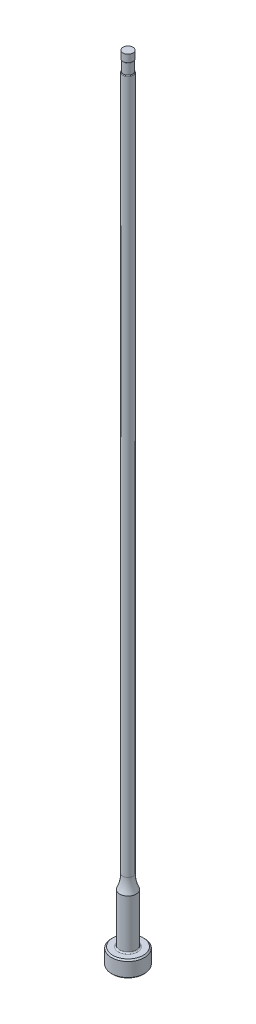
ISO-10303-21;
HEADER;
FILE_DESCRIPTION(('STEP AP214'),'2;1');
FILE_NAME('part.step','',(''),(''),'','','');
FILE_SCHEMA(('AUTOMOTIVE_DESIGN { 1 0 10303 214 1 1 1 1 }'));
ENDSEC;
DATA;
#1=APPLICATION_CONTEXT('core data for automotive mechanical design processes');
#2=APPLICATION_PROTOCOL_DEFINITION('international standard','automotive_design',2000,#1);
#3=PRODUCT_CONTEXT('',#1,'mechanical');
#4=PRODUCT('Part','Part','',(#3));
#5=PRODUCT_RELATED_PRODUCT_CATEGORY('part','',(#4));
#6=PRODUCT_DEFINITION_FORMATION('','',#4);
#7=PRODUCT_DEFINITION_CONTEXT('part definition',#1,'design');
#8=PRODUCT_DEFINITION('design','',#6,#7);
#9=PRODUCT_DEFINITION_SHAPE('','',#8);
#10=(LENGTH_UNIT() NAMED_UNIT(*) SI_UNIT(.MILLI.,.METRE.));
#11=(NAMED_UNIT(*) PLANE_ANGLE_UNIT() SI_UNIT($,.RADIAN.));
#12=(NAMED_UNIT(*) SI_UNIT($,.STERADIAN.) SOLID_ANGLE_UNIT());
#13=UNCERTAINTY_MEASURE_WITH_UNIT(LENGTH_MEASURE(1.E-05),#10,'distance_accuracy_value','');
#14=(GEOMETRIC_REPRESENTATION_CONTEXT(3) GLOBAL_UNCERTAINTY_ASSIGNED_CONTEXT((#13)) GLOBAL_UNIT_ASSIGNED_CONTEXT((#10,
#11,#12)) REPRESENTATION_CONTEXT('',''));
#15=CARTESIAN_POINT('',(0.,0.,0.));
#16=DIRECTION('',(0.,0.,1.));
#17=DIRECTION('',(1.,0.,0.));
#18=AXIS2_PLACEMENT_3D('',#15,#16,#17);
#19=CARTESIAN_POINT('',(0.,259.958771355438,0.));
#20=DIRECTION('',(0.,1.,0.));
#21=DIRECTION('',(0.,0.,1.));
#22=AXIS2_PLACEMENT_3D('',#19,#20,#21);
#23=CYLINDRICAL_SURFACE('',#22,0.991869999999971);
#24=DIRECTION('',(0.,1.,0.));
#25=VECTOR('',#24,1.);
#26=CARTESIAN_POINT('',(-0.890269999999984,259.958771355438,-0.437293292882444));
#27=LINE('',#26,#25);
#28=CARTESIAN_POINT('',(-0.890269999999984,148.719565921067,-0.437293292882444));
#29=VERTEX_POINT('',#28);
#30=CARTESIAN_POINT('',(-0.890269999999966,111.76,-0.43729329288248));
#31=VERTEX_POINT('',#30);
#32=EDGE_CURVE('E66',#29,#31,#27,.F.);
#33=ORIENTED_EDGE('',*,*,#32,.F.);
#34=CARTESIAN_POINT('',(0.,148.719565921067,0.));
#35=DIRECTION('',(0.,1.,0.));
#36=DIRECTION('',(0.,0.,1.));
#37=AXIS2_PLACEMENT_3D('',#34,#35,#36);
#38=CIRCLE('',#37,0.991869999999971);
#39=CARTESIAN_POINT('',(-0.890269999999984,148.719565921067,0.437293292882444));
#40=VERTEX_POINT('',#39);
#41=EDGE_CURVE('E44',#29,#40,#38,.F.);
#42=ORIENTED_EDGE('',*,*,#41,.T.);
#43=DIRECTION('',(0.,1.,0.));
#44=VECTOR('',#43,1.);
#45=CARTESIAN_POINT('',(-0.890269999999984,259.958771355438,0.437293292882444));
#46=LINE('',#45,#44);
#47=CARTESIAN_POINT('',(-0.890269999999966,111.76,0.43729329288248));
#48=VERTEX_POINT('',#47);
#49=EDGE_CURVE('E72',#48,#40,#46,.T.);
#50=ORIENTED_EDGE('',*,*,#49,.F.);
#51=CARTESIAN_POINT('',(-0.890269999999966,111.76,-0.43729329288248));
#52=CARTESIAN_POINT('',(-0.890266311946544,111.726545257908,-0.437278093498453));
#53=CARTESIAN_POINT('',(-0.890798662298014,111.693083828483,-0.436215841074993));
#54=CARTESIAN_POINT('',(-0.89291221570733,111.6262670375,-0.431885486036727));
#55=CARTESIAN_POINT('',(-0.8944956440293,111.592912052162,-0.428612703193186));
#56=CARTESIAN_POINT('',(-0.898710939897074,111.526207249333,-0.419700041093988));
#57=CARTESIAN_POINT('',(-0.901354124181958,111.4928615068,-0.41403457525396));
#58=CARTESIAN_POINT('',(-0.907624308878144,111.426839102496,-0.400103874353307));
#59=CARTESIAN_POINT('',(-0.911250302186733,111.394161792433,-0.391841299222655));
#60=CARTESIAN_POINT('',(-0.919626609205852,111.327872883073,-0.371778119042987));
#61=CARTESIAN_POINT('',(-0.924431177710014,111.29432221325,-0.359795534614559));
#62=CARTESIAN_POINT('',(-0.934806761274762,111.22904822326,-0.331911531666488));
#63=CARTESIAN_POINT('',(-0.940375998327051,111.197320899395,-0.316019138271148));
#64=CARTESIAN_POINT('',(-0.950464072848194,111.144247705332,-0.283956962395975));
#65=CARTESIAN_POINT('',(-0.954903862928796,111.122269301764,-0.268819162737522));
#66=CARTESIAN_POINT('',(-0.963691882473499,111.080821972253,-0.235377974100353));
#67=CARTESIAN_POINT('',(-0.968040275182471,111.061348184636,-0.217080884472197));
#68=CARTESIAN_POINT('',(-0.974794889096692,111.032172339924,-0.183749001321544));
#69=CARTESIAN_POINT('',(-0.977361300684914,111.021390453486,-0.169697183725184));
#70=CARTESIAN_POINT('',(-0.982046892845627,111.002069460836,-0.140050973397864));
#71=CARTESIAN_POINT('',(-0.984166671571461,110.993527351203,-0.124458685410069));
#72=CARTESIAN_POINT('',(-0.987438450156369,110.980502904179,-0.0946420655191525));
#73=CARTESIAN_POINT('',(-0.988692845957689,110.975581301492,-0.080622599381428));
#74=CARTESIAN_POINT('',(-0.990613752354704,110.968085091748,-0.0519284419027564));
#75=CARTESIAN_POINT('',(-0.991280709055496,110.965508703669,-0.0372542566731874));
#76=CARTESIAN_POINT('',(-0.991951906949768,110.96291599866,-0.00760975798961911));
#77=CARTESIAN_POINT('',(-0.99195380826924,110.962908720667,0.00736141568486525));
#78=CARTESIAN_POINT('',(-0.991288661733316,110.965477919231,0.0370648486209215));
#79=CARTESIAN_POINT('',(-0.990621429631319,110.968055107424,0.0517970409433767));
#80=CARTESIAN_POINT('',(-0.988743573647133,110.975383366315,0.0798806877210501));
#81=CARTESIAN_POINT('',(-0.987561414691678,110.980020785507,0.0932643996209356));
#82=CARTESIAN_POINT('',(-0.984768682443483,110.991124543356,0.119193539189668));
#83=CARTESIAN_POINT('',(-0.983157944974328,110.997591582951,0.131738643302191));
#84=CARTESIAN_POINT('',(-0.978661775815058,111.015953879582,0.162424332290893));
#85=CARTESIAN_POINT('',(-0.975558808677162,111.028890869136,0.179909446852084));
#86=CARTESIAN_POINT('',(-0.96896763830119,111.05732520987,0.212571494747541));
#87=CARTESIAN_POINT('',(-0.965478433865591,111.072829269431,0.227742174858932));
#88=CARTESIAN_POINT('',(-0.95629354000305,111.115332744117,0.264288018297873));
#89=CARTESIAN_POINT('',(-0.950512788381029,111.143709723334,0.284029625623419));
#90=CARTESIAN_POINT('',(-0.939335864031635,111.203144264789,0.319042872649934));
#91=CARTESIAN_POINT('',(-0.933940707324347,111.234208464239,0.334303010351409));
#92=CARTESIAN_POINT('',(-0.920397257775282,111.320246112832,0.370513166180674));
#93=CARTESIAN_POINT('',(-0.912954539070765,111.376778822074,0.388004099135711));
#94=CARTESIAN_POINT('',(-0.901068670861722,111.491979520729,0.414830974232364));
#95=CARTESIAN_POINT('',(-0.896628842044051,111.550649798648,0.424157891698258));
#96=CARTESIAN_POINT('',(-0.892643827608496,111.634710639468,0.432432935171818));
#97=CARTESIAN_POINT('',(-0.891752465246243,111.659788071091,0.434264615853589));
#98=CARTESIAN_POINT('',(-0.890566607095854,111.709908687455,0.43669067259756));
#99=CARTESIAN_POINT('',(-0.890269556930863,111.734951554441,0.437290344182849));
#100=CARTESIAN_POINT('',(-0.890269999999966,111.76,0.43729329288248));
#101=B_SPLINE_CURVE_WITH_KNOTS('',3,(#51,#52,#53,#54,#55,#56,#57,#58,#59,#60,#61,#62,#63,#64,
#65,#66,#67,#68,#69,#70,#71,#72,#73,#74,#75,#76,#77,#78,#79,#80,#81,#82,#83,#84,#85,#86,#87,#88,
#89,#90,#91,#92,#93,#94,#95,#96,#97,#98,#99,#100),.UNSPECIFIED.,.F.,.F.,(4,2,2,2,2,2,2,2,2,2,2,
2,2,2,2,2,2,2,2,2,2,2,2,2,4),(0.,0.10035396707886,0.200921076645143,0.302591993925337,
0.404159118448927,0.511798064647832,0.619190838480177,0.700138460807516,0.780926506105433,
0.834449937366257,0.887901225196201,0.93244760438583,0.976960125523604,1.02162925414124,
1.06631068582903,1.10878536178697,1.15127633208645,1.21681290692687,1.28252352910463,
1.38707795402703,1.49189842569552,1.66985552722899,1.84800909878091,1.92345875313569,
1.99858341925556),.UNSPECIFIED.);
#102=EDGE_CURVE('E74',#31,#48,#101,.T.);
#103=ORIENTED_EDGE('',*,*,#102,.F.);
#104=EDGE_LOOP('',(#33,#42,#50,#103));
#105=FACE_BOUND('',#104,.T.);
#106=CARTESIAN_POINT('',(0.,15.3850932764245,0.));
#107=DIRECTION('',(0.,1.,0.));
#108=DIRECTION('',(0.,0.,1.));
#109=AXIS2_PLACEMENT_3D('',#106,#107,#108);
#110=CIRCLE('',#109,0.991869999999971);
#111=CARTESIAN_POINT('',(0.,15.3850932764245,0.991869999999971));
#112=VERTEX_POINT('',#111);
#113=EDGE_CURVE('E95',#112,#112,#110,.T.);
#114=ORIENTED_EDGE('',*,*,#113,.T.);
#115=EDGE_LOOP('',(#114));
#116=FACE_BOUND('',#115,.T.);
#117=ADVANCED_FACE('F36',(#105,#116),#23,.T.);
#118=CARTESIAN_POINT('',(0.,15.3850932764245,0.));
#119=DIRECTION('',(0.,1.,0.));
#120=DIRECTION('',(0.,0.,1.));
#121=AXIS2_PLACEMENT_3D('',#118,#119,#120);
#122=TOROIDAL_SURFACE('',#121,7.34186999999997,6.35);
#123=CARTESIAN_POINT('',(0.,12.7,0.));
#124=DIRECTION('',(0.,1.,0.));
#125=DIRECTION('',(0.,0.,1.));
#126=AXIS2_PLACEMENT_3D('',#123,#124,#125);
#127=CIRCLE('',#126,1.58749999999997);
#128=CARTESIAN_POINT('',(0.,12.7,1.58749999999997));
#129=VERTEX_POINT('',#128);
#130=EDGE_CURVE('E92',#129,#129,#127,.T.);
#131=ORIENTED_EDGE('',*,*,#130,.T.);
#132=EDGE_LOOP('',(#131));
#133=FACE_BOUND('',#132,.T.);
#134=ORIENTED_EDGE('',*,*,#113,.F.);
#135=EDGE_LOOP('',(#134));
#136=FACE_BOUND('',#135,.T.);
#137=ADVANCED_FACE('F156',(#133,#136),#122,.F.);
#138=CARTESIAN_POINT('',(0.,259.958771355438,0.));
#139=DIRECTION('',(0.,1.,0.));
#140=DIRECTION('',(0.,0.,1.));
#141=AXIS2_PLACEMENT_3D('',#138,#139,#140);
#142=CYLINDRICAL_SURFACE('',#141,1.58749999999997);
#143=CARTESIAN_POINT('',(0.,3.42900000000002,0.));
#144=DIRECTION('',(0.,1.,0.));
#145=DIRECTION('',(0.,0.,1.));
#146=AXIS2_PLACEMENT_3D('',#143,#144,#145);
#147=CIRCLE('',#146,1.58749999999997);
#148=CARTESIAN_POINT('',(0.,3.42900000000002,1.58749999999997));
#149=VERTEX_POINT('',#148);
#150=EDGE_CURVE('E110',#149,#149,#147,.T.);
#151=ORIENTED_EDGE('',*,*,#150,.T.);
#152=EDGE_LOOP('',(#151));
#153=FACE_BOUND('',#152,.T.);
#154=ORIENTED_EDGE('',*,*,#130,.F.);
#155=EDGE_LOOP('',(#154));
#156=FACE_BOUND('',#155,.T.);
#157=ADVANCED_FACE('F153',(#153,#156),#142,.T.);
#158=CARTESIAN_POINT('',(-3.17499999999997,3.175,0.));
#159=DIRECTION('',(0.,1.,0.));
#160=DIRECTION('',(0.,0.,1.));
#161=AXIS2_PLACEMENT_3D('',#158,#159,#160);
#162=PLANE('',#161);
#163=CARTESIAN_POINT('',(0.,3.175,0.));
#164=DIRECTION('',(0.,1.,0.));
#165=DIRECTION('',(0.,0.,1.));
#166=AXIS2_PLACEMENT_3D('',#163,#164,#165);
#167=CIRCLE('',#166,1.84149999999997);
#168=CARTESIAN_POINT('',(0.,3.175,1.84149999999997));
#169=VERTEX_POINT('',#168);
#170=EDGE_CURVE('E78',#169,#169,#167,.F.);
#171=ORIENTED_EDGE('',*,*,#170,.T.);
#172=EDGE_LOOP('',(#171));
#173=FACE_BOUND('',#172,.T.);
#174=CARTESIAN_POINT('',(0.,3.175,0.));
#175=DIRECTION('',(0.,1.,0.));
#176=DIRECTION('',(0.,0.,1.));
#177=AXIS2_PLACEMENT_3D('',#174,#175,#176);
#178=CIRCLE('',#177,2.92099999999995);
#179=CARTESIAN_POINT('',(0.,3.175,2.92099999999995));
#180=VERTEX_POINT('',#179);
#181=EDGE_CURVE('E98',#180,#180,#178,.T.);
#182=ORIENTED_EDGE('',*,*,#181,.T.);
#183=EDGE_LOOP('',(#182));
#184=FACE_BOUND('',#183,.T.);
#185=ADVANCED_FACE('F149',(#173,#184),#162,.T.);
#186=CARTESIAN_POINT('',(0.,259.958771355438,0.));
#187=DIRECTION('',(0.,1.,0.));
#188=DIRECTION('',(0.,0.,1.));
#189=AXIS2_PLACEMENT_3D('',#186,#187,#188);
#190=CYLINDRICAL_SURFACE('',#189,3.17499999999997);
#191=CARTESIAN_POINT('',(0.,2.92100000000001,0.));
#192=DIRECTION('',(0.,1.,0.));
#193=DIRECTION('',(0.,0.,1.));
#194=AXIS2_PLACEMENT_3D('',#191,#192,#193);
#195=CIRCLE('',#194,3.17499999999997);
#196=CARTESIAN_POINT('',(0.,2.92100000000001,3.17499999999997));
#197=VERTEX_POINT('',#196);
#198=EDGE_CURVE('E104',#197,#197,#195,.F.);
#199=ORIENTED_EDGE('',*,*,#198,.T.);
#200=EDGE_LOOP('',(#199));
#201=FACE_BOUND('',#200,.T.);
#202=CARTESIAN_POINT('',(0.,0.254000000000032,0.));
#203=DIRECTION('',(0.,-1.,0.));
#204=DIRECTION('',(0.,0.,-1.));
#205=AXIS2_PLACEMENT_3D('',#202,#203,#204);
#206=CIRCLE('',#205,3.17499999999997);
#207=CARTESIAN_POINT('',(0.,0.254000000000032,-3.17499999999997));
#208=VERTEX_POINT('',#207);
#209=EDGE_CURVE('E101',#208,#208,#206,.F.);
#210=ORIENTED_EDGE('',*,*,#209,.T.);
#211=EDGE_LOOP('',(#210));
#212=FACE_BOUND('',#211,.T.);
#213=ADVANCED_FACE('F145',(#201,#212),#190,.T.);
#214=CARTESIAN_POINT('',(0.,0.,0.));
#215=DIRECTION('',(0.,-1.,0.));
#216=DIRECTION('',(0.,0.,-1.));
#217=AXIS2_PLACEMENT_3D('',#214,#215,#216);
#218=PLANE('',#217);
#219=CARTESIAN_POINT('',(0.,0.,0.));
#220=DIRECTION('',(0.,-1.,0.));
#221=DIRECTION('',(0.,0.,-1.));
#222=AXIS2_PLACEMENT_3D('',#219,#220,#221);
#223=CIRCLE('',#222,2.92099999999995);
#224=CARTESIAN_POINT('',(0.,0.,-2.92099999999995));
#225=VERTEX_POINT('',#224);
#226=EDGE_CURVE('E107',#225,#225,#223,.T.);
#227=ORIENTED_EDGE('',*,*,#226,.T.);
#228=EDGE_LOOP('',(#227));
#229=FACE_BOUND('',#228,.T.);
#230=ADVANCED_FACE('F141',(#229),#218,.T.);
#231=CARTESIAN_POINT('',(0.,3.17499999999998,0.));
#232=DIRECTION('',(0.,-1.,0.));
#233=DIRECTION('',(0.,0.,-1.));
#234=AXIS2_PLACEMENT_3D('',#231,#232,#233);
#235=CONICAL_SURFACE('',#234,2.92099999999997,0.7853981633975);
#236=ORIENTED_EDGE('',*,*,#198,.F.);
#237=EDGE_LOOP('',(#236));
#238=FACE_BOUND('',#237,.T.);
#239=ORIENTED_EDGE('',*,*,#181,.F.);
#240=EDGE_LOOP('',(#239));
#241=FACE_BOUND('',#240,.T.);
#242=ADVANCED_FACE('F144',(#238,#241),#235,.T.);
#243=CARTESIAN_POINT('',(0.,0.254000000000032,0.));
#244=DIRECTION('',(0.,1.,0.));
#245=DIRECTION('',(0.,0.,1.));
#246=AXIS2_PLACEMENT_3D('',#243,#244,#245);
#247=CONICAL_SURFACE('',#246,3.17499999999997,0.785398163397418);
#248=ORIENTED_EDGE('',*,*,#226,.F.);
#249=EDGE_LOOP('',(#248));
#250=FACE_BOUND('',#249,.T.);
#251=ORIENTED_EDGE('',*,*,#209,.F.);
#252=EDGE_LOOP('',(#251));
#253=FACE_BOUND('',#252,.T.);
#254=ADVANCED_FACE('F245',(#250,#253),#247,.T.);
#255=CARTESIAN_POINT('',(0.,3.42900000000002,0.));
#256=DIRECTION('',(0.,1.,0.));
#257=DIRECTION('',(0.,0.,1.));
#258=AXIS2_PLACEMENT_3D('',#255,#256,#257);
#259=TOROIDAL_SURFACE('',#258,1.84149999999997,0.254);
#260=ORIENTED_EDGE('',*,*,#170,.F.);
#261=EDGE_LOOP('',(#260));
#262=FACE_BOUND('',#261,.T.);
#263=ORIENTED_EDGE('',*,*,#150,.F.);
#264=EDGE_LOOP('',(#263));
#265=FACE_BOUND('',#264,.T.);
#266=ADVANCED_FACE('F139',(#262,#265),#259,.F.);
#267=CARTESIAN_POINT('',(0.,153.448281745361,0.));
#268=DIRECTION('',(0.,1.,0.));
#269=DIRECTION('',(0.,0.,1.));
#270=AXIS2_PLACEMENT_3D('',#267,#268,#269);
#271=CYLINDRICAL_SURFACE('',#270,0.890269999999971);
#272=CARTESIAN_POINT('',(0.,150.876,0.));
#273=DIRECTION('',(0.,1.,0.));
#274=DIRECTION('',(0.,0.,1.));
#275=AXIS2_PLACEMENT_3D('',#272,#273,#274);
#276=CIRCLE('',#275,0.890269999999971);
#277=CARTESIAN_POINT('',(0.,150.876,0.890269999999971));
#278=VERTEX_POINT('',#277);
#279=EDGE_CURVE('E71',#278,#278,#276,.T.);
#280=ORIENTED_EDGE('',*,*,#279,.F.);
#281=EDGE_LOOP('',(#280));
#282=FACE_BOUND('',#281,.T.);
#283=CARTESIAN_POINT('',(0.,148.844,0.));
#284=DIRECTION('',(0.,1.,0.));
#285=DIRECTION('',(0.,0.,1.));
#286=AXIS2_PLACEMENT_3D('',#283,#284,#285);
#287=CIRCLE('',#286,0.89026999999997);
#288=CARTESIAN_POINT('',(-0.890269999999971,148.844,0.));
#289=VERTEX_POINT('',#288);
#290=EDGE_CURVE('E89',#289,#289,#287,.T.);
#291=ORIENTED_EDGE('',*,*,#290,.T.);
#292=EDGE_LOOP('',(#291));
#293=FACE_BOUND('',#292,.T.);
#294=ADVANCED_FACE('F136',(#282,#293),#271,.T.);
#295=CARTESIAN_POINT('',(-0.890269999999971,149.86,-3.17499999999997));
#296=DIRECTION('',(1.,0.,0.));
#297=DIRECTION('',(0.,1.,0.));
#298=AXIS2_PLACEMENT_3D('',#295,#296,#297);
#299=PLANE('',#298);
#300=CARTESIAN_POINT('',(-0.890269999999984,148.719565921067,0.437293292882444));
#301=CARTESIAN_POINT('',(-0.890269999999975,148.722968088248,0.437301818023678));
#302=CARTESIAN_POINT('',(-0.890269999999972,148.726360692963,0.436983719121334));
#303=CARTESIAN_POINT('',(-0.890269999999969,148.733009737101,0.43576958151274));
#304=CARTESIAN_POINT('',(-0.89026999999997,148.736267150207,0.434878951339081));
#305=CARTESIAN_POINT('',(-0.890269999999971,148.742585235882,0.432596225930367));
#306=CARTESIAN_POINT('',(-0.890269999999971,148.745646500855,0.431205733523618));
#307=CARTESIAN_POINT('',(-0.89026999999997,148.751552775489,0.42801461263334));
#308=CARTESIAN_POINT('',(-0.89026999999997,148.754397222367,0.426212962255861));
#309=CARTESIAN_POINT('',(-0.89026999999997,148.761805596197,0.420882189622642));
#310=CARTESIAN_POINT('',(-0.89026999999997,148.76614344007,0.417039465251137));
#311=CARTESIAN_POINT('',(-0.89026999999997,148.774182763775,0.408741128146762));
#312=CARTESIAN_POINT('',(-0.89026999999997,148.777882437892,0.404283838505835));
#313=CARTESIAN_POINT('',(-0.89026999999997,148.7875289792,0.391183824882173));
#314=CARTESIAN_POINT('',(-0.89026999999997,148.792853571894,0.382087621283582));
#315=CARTESIAN_POINT('',(-0.89026999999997,148.802198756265,0.363263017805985));
#316=CARTESIAN_POINT('',(-0.89026999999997,148.806215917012,0.353533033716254));
#317=CARTESIAN_POINT('',(-0.89026999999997,148.815122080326,0.328598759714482));
#318=CARTESIAN_POINT('',(-0.89026999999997,148.81938200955,0.313173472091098));
#319=CARTESIAN_POINT('',(-0.89026999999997,148.826438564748,0.28198198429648));
#320=CARTESIAN_POINT('',(-0.89026999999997,148.829231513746,0.266215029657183));
#321=CARTESIAN_POINT('',(-0.89026999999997,148.836162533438,0.218503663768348));
#322=CARTESIAN_POINT('',(-0.89026999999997,148.838797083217,0.186351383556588));
#323=CARTESIAN_POINT('',(-0.89026999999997,148.841945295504,0.128280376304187));
#324=CARTESIAN_POINT('',(-0.89026999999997,148.84277238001,0.102368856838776));
#325=CARTESIAN_POINT('',(-0.89026999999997,148.843538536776,0.063707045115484));
#326=CARTESIAN_POINT('',(-0.89026999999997,148.843715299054,0.0509633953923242));
#327=CARTESIAN_POINT('',(-0.89026999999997,148.843944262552,0.0254795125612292));
#328=CARTESIAN_POINT('',(-0.89026999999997,148.843996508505,0.0127392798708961));
#329=CARTESIAN_POINT('',(-0.89026999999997,148.844000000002,1.16242336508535E-13));
#330=B_SPLINE_CURVE_WITH_KNOTS('',3,(#300,#301,#302,#303,#304,#305,#306,#307,#308,#309,#310,
#311,#312,#313,#314,#315,#316,#317,#318,#319,#320,#321,#322,#323,#324,#325,#326,#327,#328,#329),
.UNSPECIFIED.,.F.,.F.,(4,2,2,2,2,2,2,2,2,2,2,2,2,2,4),(0.,0.010176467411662,0.0202581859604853,
0.0303078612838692,0.0403827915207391,0.0576671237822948,0.0749995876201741,0.106441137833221,
0.137964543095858,0.185843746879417,0.233842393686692,0.330464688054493,0.408243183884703,
0.446476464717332,0.484696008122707),.UNSPECIFIED.);
#331=EDGE_CURVE('E77',#40,#289,#330,.T.);
#332=ORIENTED_EDGE('',*,*,#331,.T.);
#333=CARTESIAN_POINT('',(-0.89026999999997,148.844,0.));
#334=CARTESIAN_POINT('',(-0.89026999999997,148.843969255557,-0.0211447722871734));
#335=CARTESIAN_POINT('',(-0.89026999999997,148.843844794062,-0.0422938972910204));
#336=CARTESIAN_POINT('',(-0.89026999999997,148.843189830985,-0.0846467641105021));
#337=CARTESIAN_POINT('',(-0.89026999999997,148.842658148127,-0.105850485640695));
#338=CARTESIAN_POINT('',(-0.89026999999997,148.840965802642,-0.148284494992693));
#339=CARTESIAN_POINT('',(-0.89026999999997,148.83980367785,-0.169514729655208));
#340=CARTESIAN_POINT('',(-0.89026999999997,148.836394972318,-0.2118743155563));
#341=CARTESIAN_POINT('',(-0.89026999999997,148.834149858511,-0.233003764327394));
#342=CARTESIAN_POINT('',(-0.89026999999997,148.829358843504,-0.264920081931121));
#343=CARTESIAN_POINT('',(-0.89026999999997,148.827474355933,-0.275804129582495));
#344=CARTESIAN_POINT('',(-0.89026999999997,148.823051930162,-0.297473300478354));
#345=CARTESIAN_POINT('',(-0.89026999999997,148.820512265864,-0.308258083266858));
#346=CARTESIAN_POINT('',(-0.89026999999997,148.814067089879,-0.331438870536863));
#347=CARTESIAN_POINT('',(-0.89026999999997,148.810001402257,-0.343791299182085));
#348=CARTESIAN_POINT('',(-0.89026999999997,148.800220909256,-0.367815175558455));
#349=CARTESIAN_POINT('',(-0.89026999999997,148.794514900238,-0.379489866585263));
#350=CARTESIAN_POINT('',(-0.89026999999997,148.784928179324,-0.39462357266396));
#351=CARTESIAN_POINT('',(-0.89026999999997,148.782075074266,-0.39872901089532));
#352=CARTESIAN_POINT('',(-0.89026999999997,148.775937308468,-0.406618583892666));
#353=CARTESIAN_POINT('',(-0.89026999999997,148.77265209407,-0.410402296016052));
#354=CARTESIAN_POINT('',(-0.89026999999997,148.765554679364,-0.417536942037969));
#355=CARTESIAN_POINT('',(-0.89026999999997,148.761736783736,-0.420882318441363));
#356=CARTESIAN_POINT('',(-0.89026999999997,148.753570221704,-0.426851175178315));
#357=CARTESIAN_POINT('',(-0.89026999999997,148.749223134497,-0.429476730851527));
#358=CARTESIAN_POINT('',(-0.89026999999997,148.741577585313,-0.433007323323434));
#359=CARTESIAN_POINT('',(-0.89026999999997,148.738409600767,-0.434194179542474));
#360=CARTESIAN_POINT('',(-0.89026999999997,148.731923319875,-0.436020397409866));
#361=CARTESIAN_POINT('',(-0.89026999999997,148.728605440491,-0.436661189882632));
#362=CARTESIAN_POINT('',(-0.89026999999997,148.72336752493,-0.437197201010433));
#363=CARTESIAN_POINT('',(-0.89026999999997,148.721466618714,-0.437295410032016));
#364=CARTESIAN_POINT('',(-0.89026999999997,148.719565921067,-0.437293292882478));
#365=B_SPLINE_CURVE_WITH_KNOTS('',3,(#333,#334,#335,#336,#337,#338,#339,#340,#341,#342,#343,
#344,#345,#346,#347,#348,#349,#350,#351,#352,#353,#354,#355,#356,#357,#358,#359,#360,#361,#362,
#363,#364),.UNSPECIFIED.,.F.,.F.,(4,2,2,2,2,2,2,2,2,2,2,2,2,2,2,4),(0.,0.0634413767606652,
0.127067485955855,0.190841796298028,0.254529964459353,0.287653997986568,0.32086620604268,
0.359816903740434,0.398562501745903,0.413539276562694,0.428535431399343,0.443706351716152,
0.458833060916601,0.468942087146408,0.479024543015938,0.484725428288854),.UNSPECIFIED.);
#366=EDGE_CURVE('E58',#289,#29,#365,.T.);
#367=ORIENTED_EDGE('',*,*,#366,.T.);
#368=ORIENTED_EDGE('',*,*,#32,.T.);
#369=DIRECTION('',(0.,0.,1.));
#370=VECTOR('',#369,1.);
#371=CARTESIAN_POINT('',(-0.890269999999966,111.76,-3.17499999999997));
#372=LINE('',#371,#370);
#373=EDGE_CURVE('E70',#31,#48,#372,.T.);
#374=ORIENTED_EDGE('',*,*,#373,.T.);
#375=ORIENTED_EDGE('',*,*,#49,.T.);
#376=EDGE_LOOP('',(#332,#367,#368,#374,#375));
#377=FACE_BOUND('',#376,.T.);
#378=ADVANCED_FACE('F68',(#377),#299,.F.);
#379=CARTESIAN_POINT('',(-4.06526999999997,111.76,-3.17499999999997));
#380=DIRECTION('',(0.,0.,1.));
#381=DIRECTION('',(1.,0.,0.));
#382=AXIS2_PLACEMENT_3D('',#379,#380,#381);
#383=CYLINDRICAL_SURFACE('',#382,3.175);
#384=ORIENTED_EDGE('',*,*,#373,.F.);
#385=ORIENTED_EDGE('',*,*,#102,.T.);
#386=EDGE_LOOP('',(#384,#385));
#387=FACE_BOUND('',#386,.T.);
#388=ADVANCED_FACE('F80',(#387),#383,.F.);
#389=CARTESIAN_POINT('',(0.,152.687735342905,0.));
#390=DIRECTION('',(0.,1.,0.));
#391=DIRECTION('',(0.,0.,1.));
#392=AXIS2_PLACEMENT_3D('',#389,#390,#391);
#393=CYLINDRICAL_SURFACE('',#392,0.966469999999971);
#394=CARTESIAN_POINT('',(0.,150.992397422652,0.));
#395=DIRECTION('',(0.,-1.,0.));
#396=DIRECTION('',(0.,0.,-1.));
#397=AXIS2_PLACEMENT_3D('',#394,#395,#396);
#398=CIRCLE('',#397,0.966469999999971);
#399=CARTESIAN_POINT('',(0.,150.992397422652,-0.966469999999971));
#400=VERTEX_POINT('',#399);
#401=EDGE_CURVE('E11',#400,#400,#398,.F.);
#402=ORIENTED_EDGE('',*,*,#401,.T.);
#403=EDGE_LOOP('',(#402));
#404=FACE_BOUND('',#403,.T.);
#405=CARTESIAN_POINT('',(0.,152.4,0.));
#406=DIRECTION('',(0.,1.,0.));
#407=DIRECTION('',(0.,0.,1.));
#408=AXIS2_PLACEMENT_3D('',#405,#406,#407);
#409=CIRCLE('',#408,0.966469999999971);
#410=CARTESIAN_POINT('',(0.,152.4,0.966469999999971));
#411=VERTEX_POINT('',#410);
#412=EDGE_CURVE('E81',#411,#411,#409,.T.);
#413=ORIENTED_EDGE('',*,*,#412,.F.);
#414=EDGE_LOOP('',(#413));
#415=FACE_BOUND('',#414,.T.);
#416=ADVANCED_FACE('F133',(#404,#415),#393,.T.);
#417=CARTESIAN_POINT('',(-0.99186999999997,152.4,0.));
#418=DIRECTION('',(0.,1.,0.));
#419=DIRECTION('',(0.,0.,1.));
#420=AXIS2_PLACEMENT_3D('',#417,#418,#419);
#421=PLANE('',#420);
#422=ORIENTED_EDGE('',*,*,#412,.T.);
#423=EDGE_LOOP('',(#422));
#424=FACE_BOUND('',#423,.T.);
#425=ADVANCED_FACE('F177',(#424),#421,.T.);
#426=CARTESIAN_POINT('',(0.,148.719565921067,0.));
#427=DIRECTION('',(0.,1.,0.));
#428=DIRECTION('',(0.,0.,1.));
#429=AXIS2_PLACEMENT_3D('',#426,#427,#428);
#430=TOROIDAL_SURFACE('',#429,0.864869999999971,0.127);
#431=ORIENTED_EDGE('',*,*,#331,.F.);
#432=ORIENTED_EDGE('',*,*,#41,.F.);
#433=ORIENTED_EDGE('',*,*,#366,.F.);
#434=ORIENTED_EDGE('',*,*,#290,.F.);
#435=EDGE_LOOP('',(#431,#432,#433,#434));
#436=FACE_BOUND('',#435,.T.);
#437=ADVANCED_FACE('F209',(#436),#430,.T.);
#438=CARTESIAN_POINT('',(0.,150.992397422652,0.));
#439=DIRECTION('',(0.,-1.,0.));
#440=DIRECTION('',(0.,0.,-1.));
#441=AXIS2_PLACEMENT_3D('',#438,#439,#440);
#442=TOROIDAL_SURFACE('',#441,0.839469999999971,0.127);
#443=ORIENTED_EDGE('',*,*,#279,.T.);
#444=EDGE_LOOP('',(#443));
#445=FACE_BOUND('',#444,.T.);
#446=ORIENTED_EDGE('',*,*,#401,.F.);
#447=EDGE_LOOP('',(#446));
#448=FACE_BOUND('',#447,.T.);
#449=ADVANCED_FACE('F38',(#445,#448),#442,.T.);
#450=CLOSED_SHELL('',(#117,#137,#157,#185,#213,#230,#242,#254,#266,#294,#378,#388,#416,#425,
#437,#449));
#451=MANIFOLD_SOLID_BREP('B2',#450);
#452=ADVANCED_BREP_SHAPE_REPRESENTATION('',(#18,#451),#14);
#453=SHAPE_DEFINITION_REPRESENTATION(#9,#452);
ENDSEC;
END-ISO-10303-21;
